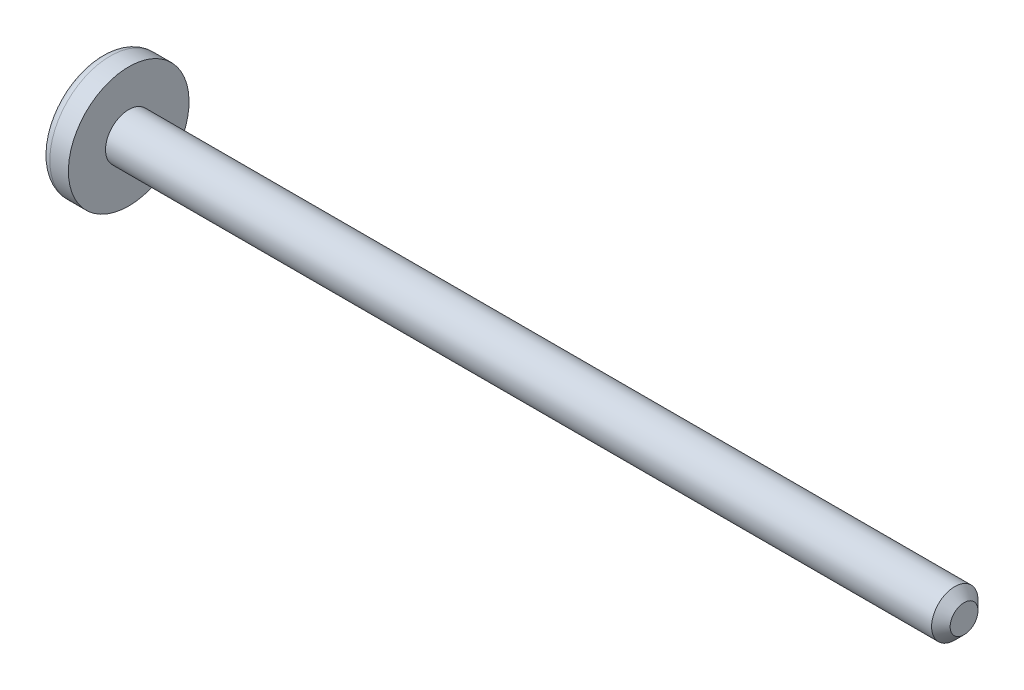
ISO-10303-21;
HEADER;
FILE_DESCRIPTION(('STEP AP214'),'2;1');
FILE_NAME('part.step','',(''),(''),'','','');
FILE_SCHEMA(('AUTOMOTIVE_DESIGN { 1 0 10303 214 1 1 1 1 }'));
ENDSEC;
DATA;
#1=APPLICATION_CONTEXT('core data for automotive mechanical design processes');
#2=APPLICATION_PROTOCOL_DEFINITION('international standard','automotive_design',2000,#1);
#3=PRODUCT_CONTEXT('',#1,'mechanical');
#4=PRODUCT('Part','Part','',(#3));
#5=PRODUCT_RELATED_PRODUCT_CATEGORY('part','',(#4));
#6=PRODUCT_DEFINITION_FORMATION('','',#4);
#7=PRODUCT_DEFINITION_CONTEXT('part definition',#1,'design');
#8=PRODUCT_DEFINITION('design','',#6,#7);
#9=PRODUCT_DEFINITION_SHAPE('','',#8);
#10=(LENGTH_UNIT() NAMED_UNIT(*) SI_UNIT(.MILLI.,.METRE.));
#11=(NAMED_UNIT(*) PLANE_ANGLE_UNIT() SI_UNIT($,.RADIAN.));
#12=(NAMED_UNIT(*) SI_UNIT($,.STERADIAN.) SOLID_ANGLE_UNIT());
#13=UNCERTAINTY_MEASURE_WITH_UNIT(LENGTH_MEASURE(1.E-05),#10,'distance_accuracy_value','');
#14=(GEOMETRIC_REPRESENTATION_CONTEXT(3) GLOBAL_UNCERTAINTY_ASSIGNED_CONTEXT((#13)) GLOBAL_UNIT_ASSIGNED_CONTEXT((#10,
#11,#12)) REPRESENTATION_CONTEXT('',''));
#15=CARTESIAN_POINT('',(0.,0.,0.));
#16=DIRECTION('',(0.,0.,1.));
#17=DIRECTION('',(1.,0.,0.));
#18=AXIS2_PLACEMENT_3D('',#15,#16,#17);
#19=CARTESIAN_POINT('',(186.,0.,0.));
#20=DIRECTION('',(-1.,0.,0.));
#21=DIRECTION('',(0.,-1.,0.));
#22=AXIS2_PLACEMENT_3D('',#19,#20,#21);
#23=CYLINDRICAL_SURFACE('',#22,5.);
#24=CARTESIAN_POINT('',(184.,0.,0.));
#25=DIRECTION('',(1.,0.,0.));
#26=DIRECTION('',(0.,1.,0.));
#27=AXIS2_PLACEMENT_3D('',#24,#25,#26);
#28=CIRCLE('',#27,5.);
#29=CARTESIAN_POINT('',(184.,4.99999999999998,0.));
#30=VERTEX_POINT('',#29);
#31=EDGE_CURVE('E36',#30,#30,#28,.F.);
#32=ORIENTED_EDGE('',*,*,#31,.T.);
#33=EDGE_LOOP('',(#32));
#34=FACE_BOUND('',#33,.T.);
#35=CARTESIAN_POINT('',(6.00000000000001,0.,0.));
#36=DIRECTION('',(-1.,0.,0.));
#37=DIRECTION('',(0.,-1.,0.));
#38=AXIS2_PLACEMENT_3D('',#35,#36,#37);
#39=CIRCLE('',#38,5.);
#40=CARTESIAN_POINT('',(6.,-5.,0.));
#41=VERTEX_POINT('',#40);
#42=EDGE_CURVE('E52',#41,#41,#39,.T.);
#43=ORIENTED_EDGE('',*,*,#42,.F.);
#44=EDGE_LOOP('',(#43));
#45=FACE_BOUND('',#44,.T.);
#46=ADVANCED_FACE('F29',(#34,#45),#23,.T.);
#47=CARTESIAN_POINT('',(186.,4.99999999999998,0.));
#48=DIRECTION('',(1.,0.,0.));
#49=DIRECTION('',(0.,1.,0.));
#50=AXIS2_PLACEMENT_3D('',#47,#48,#49);
#51=PLANE('',#50);
#52=CARTESIAN_POINT('',(186.,0.,0.));
#53=DIRECTION('',(1.,0.,0.));
#54=DIRECTION('',(0.,1.,0.));
#55=AXIS2_PLACEMENT_3D('',#52,#53,#54);
#56=CIRCLE('',#55,3.00000000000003);
#57=CARTESIAN_POINT('',(186.,3.00000000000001,0.));
#58=VERTEX_POINT('',#57);
#59=EDGE_CURVE('E10',#58,#58,#56,.T.);
#60=ORIENTED_EDGE('',*,*,#59,.T.);
#61=EDGE_LOOP('',(#60));
#62=FACE_BOUND('',#61,.T.);
#63=ADVANCED_FACE('F60',(#62),#51,.T.);
#64=CARTESIAN_POINT('',(0.,0.,0.));
#65=DIRECTION('',(-1.,0.,0.));
#66=DIRECTION('',(0.,-1.,0.));
#67=AXIS2_PLACEMENT_3D('',#64,#65,#66);
#68=PLANE('',#67);
#69=CARTESIAN_POINT('',(0.,0.,0.));
#70=DIRECTION('',(-1.,0.,0.));
#71=DIRECTION('',(0.,-1.,0.));
#72=AXIS2_PLACEMENT_3D('',#69,#70,#71);
#73=CIRCLE('',#72,11.);
#74=CARTESIAN_POINT('',(0.,-11.,0.));
#75=VERTEX_POINT('',#74);
#76=EDGE_CURVE('E44',#75,#75,#73,.T.);
#77=ORIENTED_EDGE('',*,*,#76,.T.);
#78=EDGE_LOOP('',(#77));
#79=FACE_BOUND('',#78,.T.);
#80=ADVANCED_FACE('F66',(#79),#68,.T.);
#81=CARTESIAN_POINT('',(186.,0.,0.));
#82=DIRECTION('',(-1.,0.,0.));
#83=DIRECTION('',(0.,-1.,0.));
#84=AXIS2_PLACEMENT_3D('',#81,#82,#83);
#85=CYLINDRICAL_SURFACE('',#84,13.);
#86=CARTESIAN_POINT('',(2.,0.,0.));
#87=DIRECTION('',(-1.,0.,0.));
#88=DIRECTION('',(0.,-1.,0.));
#89=AXIS2_PLACEMENT_3D('',#86,#87,#88);
#90=CIRCLE('',#89,13.);
#91=CARTESIAN_POINT('',(2.,-13.,0.));
#92=VERTEX_POINT('',#91);
#93=EDGE_CURVE('E40',#92,#92,#90,.F.);
#94=ORIENTED_EDGE('',*,*,#93,.T.);
#95=EDGE_LOOP('',(#94));
#96=FACE_BOUND('',#95,.T.);
#97=CARTESIAN_POINT('',(6.00000000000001,0.,0.));
#98=DIRECTION('',(-1.,0.,0.));
#99=DIRECTION('',(0.,-1.,0.));
#100=AXIS2_PLACEMENT_3D('',#97,#98,#99);
#101=CIRCLE('',#100,13.);
#102=CARTESIAN_POINT('',(6.,-13.,0.));
#103=VERTEX_POINT('',#102);
#104=EDGE_CURVE('E49',#103,#103,#101,.T.);
#105=ORIENTED_EDGE('',*,*,#104,.T.);
#106=EDGE_LOOP('',(#105));
#107=FACE_BOUND('',#106,.T.);
#108=ADVANCED_FACE('F76',(#96,#107),#85,.T.);
#109=CARTESIAN_POINT('',(6.,13.,0.));
#110=DIRECTION('',(1.,0.,0.));
#111=DIRECTION('',(0.,1.,0.));
#112=AXIS2_PLACEMENT_3D('',#109,#110,#111);
#113=PLANE('',#112);
#114=ORIENTED_EDGE('',*,*,#42,.T.);
#115=EDGE_LOOP('',(#114));
#116=FACE_BOUND('',#115,.T.);
#117=ORIENTED_EDGE('',*,*,#104,.F.);
#118=EDGE_LOOP('',(#117));
#119=FACE_BOUND('',#118,.T.);
#120=ADVANCED_FACE('F56',(#116,#119),#113,.T.);
#121=CARTESIAN_POINT('',(2.,0.,0.));
#122=DIRECTION('',(-1.,0.,0.));
#123=DIRECTION('',(0.,-1.,0.));
#124=AXIS2_PLACEMENT_3D('',#121,#122,#123);
#125=TOROIDAL_SURFACE('',#124,11.,2.);
#126=ORIENTED_EDGE('',*,*,#93,.F.);
#127=EDGE_LOOP('',(#126));
#128=FACE_BOUND('',#127,.T.);
#129=ORIENTED_EDGE('',*,*,#76,.F.);
#130=EDGE_LOOP('',(#129));
#131=FACE_BOUND('',#130,.T.);
#132=ADVANCED_FACE('F69',(#128,#131),#125,.T.);
#133=CARTESIAN_POINT('',(184.,0.,0.));
#134=DIRECTION('',(-1.,0.,0.));
#135=DIRECTION('',(0.,-1.,0.));
#136=AXIS2_PLACEMENT_3D('',#133,#134,#135);
#137=CONICAL_SURFACE('',#136,5.,0.78539816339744);
#138=ORIENTED_EDGE('',*,*,#59,.F.);
#139=EDGE_LOOP('',(#138));
#140=FACE_BOUND('',#139,.T.);
#141=ORIENTED_EDGE('',*,*,#31,.F.);
#142=EDGE_LOOP('',(#141));
#143=FACE_BOUND('',#142,.T.);
#144=ADVANCED_FACE('F31',(#140,#143),#137,.T.);
#145=CLOSED_SHELL('',(#46,#63,#80,#108,#120,#132,#144));
#146=MANIFOLD_SOLID_BREP('B2',#145);
#147=ADVANCED_BREP_SHAPE_REPRESENTATION('',(#18,#146),#14);
#148=SHAPE_DEFINITION_REPRESENTATION(#9,#147);
ENDSEC;
END-ISO-10303-21;
